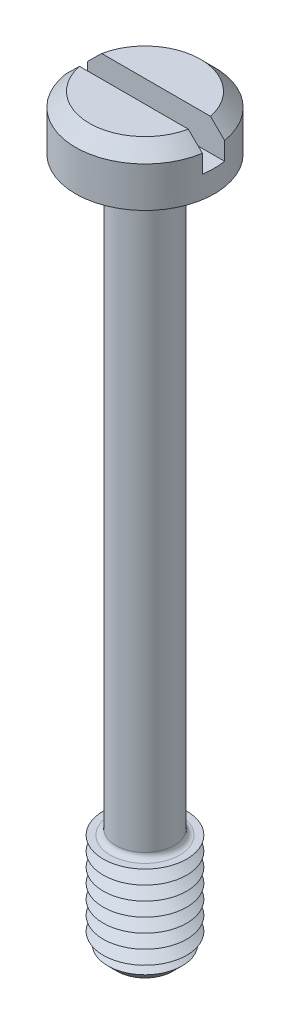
ISO-10303-21;
HEADER;
FILE_DESCRIPTION(('STEP AP214'),'2;1');
FILE_NAME('part.step','',(''),(''),'','','');
FILE_SCHEMA(('AUTOMOTIVE_DESIGN { 1 0 10303 214 1 1 1 1 }'));
ENDSEC;
DATA;
#1=APPLICATION_CONTEXT('core data for automotive mechanical design processes');
#2=APPLICATION_PROTOCOL_DEFINITION('international standard','automotive_design',2000,#1);
#3=PRODUCT_CONTEXT('',#1,'mechanical');
#4=PRODUCT('Part','Part','',(#3));
#5=PRODUCT_RELATED_PRODUCT_CATEGORY('part','',(#4));
#6=PRODUCT_DEFINITION_FORMATION('','',#4);
#7=PRODUCT_DEFINITION_CONTEXT('part definition',#1,'design');
#8=PRODUCT_DEFINITION('design','',#6,#7);
#9=PRODUCT_DEFINITION_SHAPE('','',#8);
#10=(LENGTH_UNIT() NAMED_UNIT(*) SI_UNIT(.MILLI.,.METRE.));
#11=(NAMED_UNIT(*) PLANE_ANGLE_UNIT() SI_UNIT($,.RADIAN.));
#12=(NAMED_UNIT(*) SI_UNIT($,.STERADIAN.) SOLID_ANGLE_UNIT());
#13=UNCERTAINTY_MEASURE_WITH_UNIT(LENGTH_MEASURE(1.E-05),#10,'distance_accuracy_value','');
#14=(GEOMETRIC_REPRESENTATION_CONTEXT(3) GLOBAL_UNCERTAINTY_ASSIGNED_CONTEXT((#13)) GLOBAL_UNIT_ASSIGNED_CONTEXT((#10,
#11,#12)) REPRESENTATION_CONTEXT('',''));
#15=CARTESIAN_POINT('',(0.,0.,0.));
#16=DIRECTION('',(0.,0.,1.));
#17=DIRECTION('',(1.,0.,0.));
#18=AXIS2_PLACEMENT_3D('',#15,#16,#17);
#19=CARTESIAN_POINT('',(0.,3.9,0.));
#20=DIRECTION('',(0.,1.,0.));
#21=DIRECTION('',(0.,0.,1.));
#22=AXIS2_PLACEMENT_3D('',#19,#20,#21);
#23=PLANE('',#22);
#24=DIRECTION('',(-1.,0.,0.));
#25=VECTOR('',#24,1.);
#26=CARTESIAN_POINT('',(5.,3.9,-0.8));
#27=LINE('',#26,#25);
#28=CARTESIAN_POINT('',(3.91918358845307,3.9,-0.8));
#29=VERTEX_POINT('',#28);
#30=CARTESIAN_POINT('',(-3.91918358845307,3.9,-0.8));
#31=VERTEX_POINT('',#30);
#32=EDGE_CURVE('E110',#29,#31,#27,.T.);
#33=ORIENTED_EDGE('',*,*,#32,.F.);
#34=CARTESIAN_POINT('',(0.,3.9,0.));
#35=DIRECTION('',(0.,1.,0.));
#36=DIRECTION('',(0.,0.,1.));
#37=AXIS2_PLACEMENT_3D('',#34,#35,#36);
#38=CIRCLE('',#37,3.99999999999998);
#39=EDGE_CURVE('E113',#29,#31,#38,.T.);
#40=ORIENTED_EDGE('',*,*,#39,.T.);
#41=EDGE_LOOP('',(#33,#40));
#42=FACE_BOUND('',#41,.T.);
#43=ADVANCED_FACE('F39',(#42),#23,.T.);
#44=CARTESIAN_POINT('',(0.,3.9,0.));
#45=DIRECTION('',(0.,-1.,0.));
#46=DIRECTION('',(0.,0.,-1.));
#47=AXIS2_PLACEMENT_3D('',#44,#45,#46);
#48=CONICAL_SURFACE('',#47,3.99999999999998,0.785398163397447);
#49=CARTESIAN_POINT('',(11.0010756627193,-3.13012537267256,-0.8));
#50=CARTESIAN_POINT('',(10.6180645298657,-2.74813121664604,-0.8));
#51=CARTESIAN_POINT('',(10.2350087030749,-2.36618183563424,-0.8));
#52=CARTESIAN_POINT('',(9.46873746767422,-1.60241986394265,-0.8));
#53=CARTESIAN_POINT('',(9.08552205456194,-1.22060727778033,-0.8));
#54=CARTESIAN_POINT('',(8.31861292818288,-0.456918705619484,-0.8));
#55=CARTESIAN_POINT('',(7.93491906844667,-0.0750428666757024,-0.8));
#56=CARTESIAN_POINT('',(7.16722555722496,0.688378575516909,-0.8));
#57=CARTESIAN_POINT('',(6.78322591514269,1.06992418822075,-0.8));
#58=CARTESIAN_POINT('',(6.01856215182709,1.82868912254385,-0.8));
#59=CARTESIAN_POINT('',(5.63790309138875,2.20591354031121,-0.8));
#60=CARTESIAN_POINT('',(5.06622054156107,2.77108317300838,-0.8));
#61=CARTESIAN_POINT('',(4.87553531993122,2.95937045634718,-0.8));
#62=CARTESIAN_POINT('',(4.49384424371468,3.3356164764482,-0.8));
#63=CARTESIAN_POINT('',(4.30283839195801,3.52357521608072,-0.8));
#64=CARTESIAN_POINT('',(3.92044271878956,3.89893397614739,-0.8));
#65=CARTESIAN_POINT('',(3.72905310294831,4.08633420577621,-0.8));
#66=CARTESIAN_POINT('',(3.34554223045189,4.46039762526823,-0.8));
#67=CARTESIAN_POINT('',(3.15342094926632,4.64706078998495,-0.8));
#68=CARTESIAN_POINT('',(2.76802565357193,5.01913697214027,-0.8));
#69=CARTESIAN_POINT('',(2.57475182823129,5.20455018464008,-0.8));
#70=CARTESIAN_POINT('',(2.28318236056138,5.48091108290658,-0.8));
#71=CARTESIAN_POINT('',(2.1857187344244,5.57273577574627,-0.8));
#72=CARTESIAN_POINT('',(1.98998431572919,5.75552004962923,-0.8));
#73=CARTESIAN_POINT('',(1.89171354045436,5.84647964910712,-0.8));
#74=CARTESIAN_POINT('',(1.76578543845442,5.96147491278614,-0.8));
#75=CARTESIAN_POINT('',(1.73869031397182,5.98612635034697,-0.8));
#76=CARTESIAN_POINT('',(1.68439529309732,6.03531372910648,-0.8));
#77=CARTESIAN_POINT('',(1.65719539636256,6.05984966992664,-0.8));
#78=CARTESIAN_POINT('',(1.5754162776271,6.13326356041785,-0.8));
#79=CARTESIAN_POINT('',(1.52066027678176,6.18194515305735,-0.8));
#80=CARTESIAN_POINT('',(1.41038257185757,6.27874171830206,-0.8));
#81=CARTESIAN_POINT('',(1.35485918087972,6.32685477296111,-0.8));
#82=CARTESIAN_POINT('',(1.24299231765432,6.42210730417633,-0.8));
#83=CARTESIAN_POINT('',(1.18664895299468,6.46924690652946,-0.8));
#84=CARTESIAN_POINT('',(1.07845249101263,6.55754663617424,-0.8));
#85=CARTESIAN_POINT('',(1.02670624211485,6.59883713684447,-0.8));
#86=CARTESIAN_POINT('',(0.921961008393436,6.67979338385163,-0.8));
#87=CARTESIAN_POINT('',(0.868962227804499,6.71945939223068,-0.8));
#88=CARTESIAN_POINT('',(0.761295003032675,6.79630361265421,-0.8));
#89=CARTESIAN_POINT('',(0.706629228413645,6.83348552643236,-0.8));
#90=CARTESIAN_POINT('',(0.594896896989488,6.90399895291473,-0.8));
#91=CARTESIAN_POINT('',(0.537833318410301,6.93733506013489,-0.8));
#92=CARTESIAN_POINT('',(0.428390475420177,6.99356340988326,-0.8));
#93=CARTESIAN_POINT('',(0.376435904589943,7.01726022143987,-0.8));
#94=CARTESIAN_POINT('',(0.269759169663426,7.05717670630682,-0.8));
#95=CARTESIAN_POINT('',(0.215046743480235,7.07342088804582,-0.8));
#96=CARTESIAN_POINT('',(0.11301666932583,7.09332110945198,-0.8));
#97=CARTESIAN_POINT('',(0.0660435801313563,7.09866042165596,-0.8));
#98=CARTESIAN_POINT('',(-0.0280587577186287,7.1008887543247,-0.8));
#99=CARTESIAN_POINT('',(-0.0751877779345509,7.09778705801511,-0.8));
#100=CARTESIAN_POINT('',(-0.180723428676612,7.08192474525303,-0.8));
#101=CARTESIAN_POINT('',(-0.238762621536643,7.06679554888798,-0.8));
#102=CARTESIAN_POINT('',(-0.323499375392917,7.03748409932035,-0.8));
#103=CARTESIAN_POINT('',(-0.351441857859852,7.02656594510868,-0.8));
#104=CARTESIAN_POINT('',(-0.406569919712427,7.00295901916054,-0.8));
#105=CARTESIAN_POINT('',(-0.433755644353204,6.99027059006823,-0.8));
#106=CARTESIAN_POINT('',(-0.504673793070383,6.95489235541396,-0.8));
#107=CARTESIAN_POINT('',(-0.547808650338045,6.9310167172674,-0.8));
#108=CARTESIAN_POINT('',(-0.632566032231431,6.88069648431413,-0.8));
#109=CARTESIAN_POINT('',(-0.674187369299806,6.85424992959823,-0.8));
#110=CARTESIAN_POINT('',(-0.756326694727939,6.79950439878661,-0.8));
#111=CARTESIAN_POINT('',(-0.796841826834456,6.7712011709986,-0.8));
#112=CARTESIAN_POINT('',(-0.876938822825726,6.71329852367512,-0.8));
#113=CARTESIAN_POINT('',(-0.916520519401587,6.68369887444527,-0.8));
#114=CARTESIAN_POINT('',(-1.0346590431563,6.59312324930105,-0.8));
#115=CARTESIAN_POINT('',(-1.11211338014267,6.53071425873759,-0.8));
#116=CARTESIAN_POINT('',(-1.2650545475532,6.40381418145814,-0.8));
#117=CARTESIAN_POINT('',(-1.34054439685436,6.33932667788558,-0.8));
#118=CARTESIAN_POINT('',(-1.48913173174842,6.20997083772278,-0.8));
#119=CARTESIAN_POINT('',(-1.56224816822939,6.14512422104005,-0.8));
#120=CARTESIAN_POINT('',(-1.70765393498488,6.01451044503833,-0.8));
#121=CARTESIAN_POINT('',(-1.77994324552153,5.94874326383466,-0.8));
#122=CARTESIAN_POINT('',(-1.99594639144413,5.75046596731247,-0.8));
#123=CARTESIAN_POINT('',(-2.13877767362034,5.61699583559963,-0.8));
#124=CARTESIAN_POINT('',(-2.4232463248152,5.34853800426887,-0.8));
#125=CARTESIAN_POINT('',(-2.56488247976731,5.21354902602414,-0.8));
#126=CARTESIAN_POINT('',(-2.84730929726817,4.94270932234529,-0.8));
#127=CARTESIAN_POINT('',(-2.98810001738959,4.80685865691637,-0.8));
#128=CARTESIAN_POINT('',(-3.26818763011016,4.53549974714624,-0.8));
#129=CARTESIAN_POINT('',(-3.40748821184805,4.39999530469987,-0.8));
#130=CARTESIAN_POINT('',(-3.68570899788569,4.12859172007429,-0.8));
#131=CARTESIAN_POINT('',(-3.82462919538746,3.99269257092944,-0.8));
#132=CARTESIAN_POINT('',(-4.24087543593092,3.58468153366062,-0.8));
#133=CARTESIAN_POINT('',(-4.51779300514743,3.31215310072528,-0.8));
#134=CARTESIAN_POINT('',(-5.05279381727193,2.7844393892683,-0.8));
#135=CARTESIAN_POINT('',(-5.31091639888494,2.52929393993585,-0.8));
#136=CARTESIAN_POINT('',(-5.82680751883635,2.01864429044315,-0.8));
#137=CARTESIAN_POINT('',(-6.08457605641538,1.76314008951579,-0.8));
#138=CARTESIAN_POINT('',(-6.85760508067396,0.996194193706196,-0.8));
#139=CARTESIAN_POINT('',(-7.37251152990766,0.484395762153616,-0.8));
#140=CARTESIAN_POINT('',(-8.40657233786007,-0.544392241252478,-0.8));
#141=CARTESIAN_POINT('',(-8.92572224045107,-1.06138628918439,-0.8));
#142=CARTESIAN_POINT('',(-9.9636287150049,-2.09560660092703,-0.8));
#143=CARTESIAN_POINT('',(-10.4823853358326,-2.61283281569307,-0.8));
#144=CARTESIAN_POINT('',(-11.0010756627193,-3.13012537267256,-0.8));
#145=B_SPLINE_CURVE_WITH_KNOTS('',3,(#49,#50,#51,#52,#53,#54,#55,#56,#57,#58,#59,#60,#61,#62,
#63,#64,#65,#66,#67,#68,#69,#70,#71,#72,#73,#74,#75,#76,#77,#78,#79,#80,#81,#82,#83,#84,#85,#86,
#87,#88,#89,#90,#91,#92,#93,#94,#95,#96,#97,#98,#99,#100,#101,#102,#103,#104,#105,#106,#107,
#108,#109,#110,#111,#112,#113,#114,#115,#116,#117,#118,#119,#120,#121,#122,#123,#124,#125,#126,
#127,#128,#129,#130,#131,#132,#133,#134,#135,#136,#137,#138,#139,#140,#141,#142,#143,#144),
.UNSPECIFIED.,.F.,.F.,(4,2,2,2,2,2,2,2,2,2,2,2,2,2,2,2,2,2,2,2,2,2,2,2,2,2,2,2,2,2,2,2,2,2,2,2,
2,2,2,2,2,2,2,2,2,2,2,4),(0.,1.62282275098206,3.24569489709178,4.86971791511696,
6.49369278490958,8.10142191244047,8.90535980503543,9.70929063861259,10.5128682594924,
11.3164730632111,12.1199494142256,12.5216659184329,12.9233738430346,13.0332669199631,
13.1431603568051,13.3629580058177,13.5833578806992,13.8037290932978,14.0023112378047,
14.2008612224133,14.3991084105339,14.5971162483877,14.7680800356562,14.9384774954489,
15.0795987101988,15.2205647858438,15.3993585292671,15.4893211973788,15.5792664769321,
15.727032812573,15.8749126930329,16.0231439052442,16.1714014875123,16.4697244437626,
16.767558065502,17.0607348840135,17.35391868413,17.9403574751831,18.5273336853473,
19.1142694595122,19.6972736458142,20.2802881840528,21.4458742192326,22.5346981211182,
23.6235243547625,25.8015035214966,27.9995014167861,30.1971550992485),.UNSPECIFIED.);
#146=CARTESIAN_POINT('',(4.93558507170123,2.89999999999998,-0.8));
#147=VERTEX_POINT('',#146);
#148=EDGE_CURVE('E252',#147,#29,#145,.T.);
#149=ORIENTED_EDGE('',*,*,#148,.F.);
#150=CARTESIAN_POINT('',(0.,2.89999999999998,0.));
#151=DIRECTION('',(0.,1.,0.));
#152=DIRECTION('',(0.,0.,1.));
#153=AXIS2_PLACEMENT_3D('',#150,#151,#152);
#154=CIRCLE('',#153,5.);
#155=CARTESIAN_POINT('',(-4.93558507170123,2.89999999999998,-0.8));
#156=VERTEX_POINT('',#155);
#157=EDGE_CURVE('E128',#156,#147,#154,.F.);
#158=ORIENTED_EDGE('',*,*,#157,.F.);
#159=EDGE_CURVE('E102',#31,#156,#145,.T.);
#160=ORIENTED_EDGE('',*,*,#159,.F.);
#161=ORIENTED_EDGE('',*,*,#39,.F.);
#162=EDGE_LOOP('',(#149,#158,#160,#161));
#163=FACE_BOUND('',#162,.T.);
#164=ADVANCED_FACE('F214',(#163),#48,.T.);
#165=CARTESIAN_POINT('',(0.,-50.,0.));
#166=DIRECTION('',(0.,1.,0.));
#167=DIRECTION('',(0.,0.,1.));
#168=AXIS2_PLACEMENT_3D('',#165,#166,#167);
#169=CYLINDRICAL_SURFACE('',#168,2.1);
#170=CARTESIAN_POINT('',(0.,-42.1,0.));
#171=DIRECTION('',(0.,-1.,0.));
#172=DIRECTION('',(0.,0.,-1.));
#173=AXIS2_PLACEMENT_3D('',#170,#171,#172);
#174=CIRCLE('',#173,2.1);
#175=CARTESIAN_POINT('',(0.,-42.1,-2.1));
#176=VERTEX_POINT('',#175);
#177=EDGE_CURVE('E123',#176,#176,#174,.F.);
#178=ORIENTED_EDGE('',*,*,#177,.T.);
#179=EDGE_LOOP('',(#178));
#180=FACE_BOUND('',#179,.T.);
#181=CARTESIAN_POINT('',(0.,-0.399999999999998,0.));
#182=DIRECTION('',(0.,1.,0.));
#183=DIRECTION('',(0.,0.,1.));
#184=AXIS2_PLACEMENT_3D('',#181,#182,#183);
#185=CIRCLE('',#184,2.1);
#186=CARTESIAN_POINT('',(0.,-0.399999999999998,2.1));
#187=VERTEX_POINT('',#186);
#188=EDGE_CURVE('E350',#187,#187,#185,.F.);
#189=ORIENTED_EDGE('',*,*,#188,.T.);
#190=EDGE_LOOP('',(#189));
#191=FACE_BOUND('',#190,.T.);
#192=ADVANCED_FACE('F210',(#180,#191),#169,.T.);
#193=CARTESIAN_POINT('',(0.,3.9,0.));
#194=DIRECTION('',(0.,-1.,0.));
#195=DIRECTION('',(0.,0.,-1.));
#196=AXIS2_PLACEMENT_3D('',#193,#194,#195);
#197=CYLINDRICAL_SURFACE('',#196,5.);
#198=ORIENTED_EDGE('',*,*,#157,.T.);
#199=DIRECTION('',(0.,-1.,0.));
#200=VECTOR('',#199,1.);
#201=CARTESIAN_POINT('',(4.93558507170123,3.9,-0.8));
#202=LINE('',#201,#200);
#203=CARTESIAN_POINT('',(4.93558507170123,1.6,-0.8));
#204=VERTEX_POINT('',#203);
#205=EDGE_CURVE('E64',#147,#204,#202,.T.);
#206=ORIENTED_EDGE('',*,*,#205,.T.);
#207=CARTESIAN_POINT('',(0.,1.6,0.));
#208=DIRECTION('',(0.,1.,0.));
#209=DIRECTION('',(0.,0.,1.));
#210=AXIS2_PLACEMENT_3D('',#207,#208,#209);
#211=CIRCLE('',#210,5.);
#212=CARTESIAN_POINT('',(4.93558507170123,1.6,0.8));
#213=VERTEX_POINT('',#212);
#214=EDGE_CURVE('E11',#213,#204,#211,.T.);
#215=ORIENTED_EDGE('',*,*,#214,.F.);
#216=DIRECTION('',(0.,-1.,0.));
#217=VECTOR('',#216,1.);
#218=CARTESIAN_POINT('',(4.93558507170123,3.9,0.8));
#219=LINE('',#218,#217);
#220=CARTESIAN_POINT('',(4.93558507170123,2.89999999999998,0.8));
#221=VERTEX_POINT('',#220);
#222=EDGE_CURVE('E269',#213,#221,#219,.F.);
#223=ORIENTED_EDGE('',*,*,#222,.T.);
#224=CARTESIAN_POINT('',(-4.93558507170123,2.89999999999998,0.8));
#225=VERTEX_POINT('',#224);
#226=EDGE_CURVE('E120',#221,#225,#154,.F.);
#227=ORIENTED_EDGE('',*,*,#226,.T.);
#228=DIRECTION('',(0.,-1.,0.));
#229=VECTOR('',#228,1.);
#230=CARTESIAN_POINT('',(-4.93558507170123,3.9,0.8));
#231=LINE('',#230,#229);
#232=CARTESIAN_POINT('',(-4.93558507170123,1.6,0.8));
#233=VERTEX_POINT('',#232);
#234=EDGE_CURVE('E96',#225,#233,#231,.T.);
#235=ORIENTED_EDGE('',*,*,#234,.T.);
#236=CARTESIAN_POINT('',(-4.93558507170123,1.6,-0.8));
#237=VERTEX_POINT('',#236);
#238=EDGE_CURVE('E44',#237,#233,#211,.T.);
#239=ORIENTED_EDGE('',*,*,#238,.F.);
#240=DIRECTION('',(0.,-1.,0.));
#241=VECTOR('',#240,1.);
#242=CARTESIAN_POINT('',(-4.93558507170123,3.9,-0.8));
#243=LINE('',#242,#241);
#244=EDGE_CURVE('E274',#237,#156,#243,.F.);
#245=ORIENTED_EDGE('',*,*,#244,.T.);
#246=EDGE_LOOP('',(#198,#206,#215,#223,#227,#235,#239,#245));
#247=FACE_BOUND('',#246,.T.);
#248=CARTESIAN_POINT('',(0.,0.,0.));
#249=DIRECTION('',(0.,1.,0.));
#250=DIRECTION('',(0.,0.,1.));
#251=AXIS2_PLACEMENT_3D('',#248,#249,#250);
#252=CIRCLE('',#251,5.);
#253=CARTESIAN_POINT('',(0.,0.,5.));
#254=VERTEX_POINT('',#253);
#255=EDGE_CURVE('E337',#254,#254,#252,.T.);
#256=ORIENTED_EDGE('',*,*,#255,.T.);
#257=EDGE_LOOP('',(#256));
#258=FACE_BOUND('',#257,.T.);
#259=ADVANCED_FACE('F213',(#247,#258),#197,.T.);
#260=DIRECTION('',(1.,0.,0.));
#261=VECTOR('',#260,1.);
#262=CARTESIAN_POINT('',(5.,3.9,0.8));
#263=LINE('',#262,#261);
#264=CARTESIAN_POINT('',(-3.91918358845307,3.9,0.8));
#265=VERTEX_POINT('',#264);
#266=CARTESIAN_POINT('',(3.91918358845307,3.9,0.8));
#267=VERTEX_POINT('',#266);
#268=EDGE_CURVE('E56',#265,#267,#263,.T.);
#269=ORIENTED_EDGE('',*,*,#268,.F.);
#270=EDGE_CURVE('E108',#265,#267,#38,.T.);
#271=ORIENTED_EDGE('',*,*,#270,.T.);
#272=EDGE_LOOP('',(#269,#271));
#273=FACE_BOUND('',#272,.T.);
#274=ADVANCED_FACE('F107',(#273),#23,.T.);
#275=CARTESIAN_POINT('',(0.,0.,0.));
#276=DIRECTION('',(0.,1.,0.));
#277=DIRECTION('',(0.,0.,1.));
#278=AXIS2_PLACEMENT_3D('',#275,#276,#277);
#279=PLANE('',#278);
#280=CARTESIAN_POINT('',(0.,0.,0.));
#281=DIRECTION('',(0.,1.,0.));
#282=DIRECTION('',(0.,0.,1.));
#283=AXIS2_PLACEMENT_3D('',#280,#281,#282);
#284=CIRCLE('',#283,2.5);
#285=CARTESIAN_POINT('',(0.,0.,2.5));
#286=VERTEX_POINT('',#285);
#287=EDGE_CURVE('E114',#286,#286,#284,.T.);
#288=ORIENTED_EDGE('',*,*,#287,.T.);
#289=EDGE_LOOP('',(#288));
#290=FACE_BOUND('',#289,.T.);
#291=ORIENTED_EDGE('',*,*,#255,.F.);
#292=EDGE_LOOP('',(#291));
#293=FACE_BOUND('',#292,.T.);
#294=ADVANCED_FACE('F204',(#290,#293),#279,.F.);
#295=CARTESIAN_POINT('',(0.,-42.5,0.));
#296=DIRECTION('',(0.,-1.,0.));
#297=DIRECTION('',(0.,0.,-1.));
#298=AXIS2_PLACEMENT_3D('',#295,#296,#297);
#299=PLANE('',#298);
#300=CARTESIAN_POINT('',(0.,-42.5,0.));
#301=DIRECTION('',(0.,-1.,0.));
#302=DIRECTION('',(0.,0.,-1.));
#303=AXIS2_PLACEMENT_3D('',#300,#301,#302);
#304=CIRCLE('',#303,2.5);
#305=CARTESIAN_POINT('',(0.,-42.5,-2.5));
#306=VERTEX_POINT('',#305);
#307=EDGE_CURVE('E344',#306,#306,#304,.T.);
#308=ORIENTED_EDGE('',*,*,#307,.T.);
#309=EDGE_LOOP('',(#308));
#310=FACE_BOUND('',#309,.T.);
#311=CARTESIAN_POINT('',(0.,-42.5,0.));
#312=DIRECTION('',(0.,1.,0.));
#313=DIRECTION('',(0.,0.,1.));
#314=AXIS2_PLACEMENT_3D('',#311,#312,#313);
#315=CIRCLE('',#314,3.);
#316=CARTESIAN_POINT('',(0.,-42.5,3.));
#317=VERTEX_POINT('',#316);
#318=EDGE_CURVE('E333',#317,#317,#315,.T.);
#319=ORIENTED_EDGE('',*,*,#318,.T.);
#320=EDGE_LOOP('',(#319));
#321=FACE_BOUND('',#320,.T.);
#322=ADVANCED_FACE('F200',(#310,#321),#299,.F.);
#323=CARTESIAN_POINT('',(0.,-43.,0.));
#324=DIRECTION('',(0.,1.,0.));
#325=DIRECTION('',(0.,0.,1.));
#326=AXIS2_PLACEMENT_3D('',#323,#324,#325);
#327=CONICAL_SURFACE('',#326,2.13397459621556,1.0471975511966);
#328=ORIENTED_EDGE('',*,*,#318,.F.);
#329=EDGE_LOOP('',(#328));
#330=FACE_BOUND('',#329,.T.);
#331=CARTESIAN_POINT('',(0.,-43.,0.));
#332=DIRECTION('',(0.,1.,0.));
#333=DIRECTION('',(0.,0.,1.));
#334=AXIS2_PLACEMENT_3D('',#331,#332,#333);
#335=CIRCLE('',#334,2.13397459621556);
#336=CARTESIAN_POINT('',(0.,-43.,2.13397459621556));
#337=VERTEX_POINT('',#336);
#338=EDGE_CURVE('E329',#337,#337,#335,.T.);
#339=ORIENTED_EDGE('',*,*,#338,.T.);
#340=EDGE_LOOP('',(#339));
#341=FACE_BOUND('',#340,.T.);
#342=ADVANCED_FACE('F196',(#330,#341),#327,.T.);
#343=CARTESIAN_POINT('',(0.,-43.5,0.));
#344=DIRECTION('',(0.,-1.,0.));
#345=DIRECTION('',(0.,0.,-1.));
#346=AXIS2_PLACEMENT_3D('',#343,#344,#345);
#347=CONICAL_SURFACE('',#346,3.,1.0471975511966);
#348=ORIENTED_EDGE('',*,*,#338,.F.);
#349=EDGE_LOOP('',(#348));
#350=FACE_BOUND('',#349,.T.);
#351=CARTESIAN_POINT('',(0.,-43.5,0.));
#352=DIRECTION('',(0.,1.,0.));
#353=DIRECTION('',(0.,0.,1.));
#354=AXIS2_PLACEMENT_3D('',#351,#352,#353);
#355=CIRCLE('',#354,3.);
#356=CARTESIAN_POINT('',(0.,-43.5,3.));
#357=VERTEX_POINT('',#356);
#358=EDGE_CURVE('E325',#357,#357,#355,.T.);
#359=ORIENTED_EDGE('',*,*,#358,.T.);
#360=EDGE_LOOP('',(#359));
#361=FACE_BOUND('',#360,.T.);
#362=ADVANCED_FACE('F192',(#350,#361),#347,.T.);
#363=CARTESIAN_POINT('',(0.,-44.,0.));
#364=DIRECTION('',(0.,1.,0.));
#365=DIRECTION('',(0.,0.,1.));
#366=AXIS2_PLACEMENT_3D('',#363,#364,#365);
#367=CONICAL_SURFACE('',#366,2.13397459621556,1.0471975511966);
#368=ORIENTED_EDGE('',*,*,#358,.F.);
#369=EDGE_LOOP('',(#368));
#370=FACE_BOUND('',#369,.T.);
#371=CARTESIAN_POINT('',(0.,-44.,0.));
#372=DIRECTION('',(0.,1.,0.));
#373=DIRECTION('',(0.,0.,1.));
#374=AXIS2_PLACEMENT_3D('',#371,#372,#373);
#375=CIRCLE('',#374,2.13397459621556);
#376=CARTESIAN_POINT('',(0.,-44.,2.13397459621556));
#377=VERTEX_POINT('',#376);
#378=EDGE_CURVE('E321',#377,#377,#375,.T.);
#379=ORIENTED_EDGE('',*,*,#378,.T.);
#380=EDGE_LOOP('',(#379));
#381=FACE_BOUND('',#380,.T.);
#382=ADVANCED_FACE('F188',(#370,#381),#367,.T.);
#383=CARTESIAN_POINT('',(0.,-44.5,0.));
#384=DIRECTION('',(0.,-1.,0.));
#385=DIRECTION('',(0.,0.,-1.));
#386=AXIS2_PLACEMENT_3D('',#383,#384,#385);
#387=CONICAL_SURFACE('',#386,3.,1.0471975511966);
#388=ORIENTED_EDGE('',*,*,#378,.F.);
#389=EDGE_LOOP('',(#388));
#390=FACE_BOUND('',#389,.T.);
#391=CARTESIAN_POINT('',(0.,-44.5,0.));
#392=DIRECTION('',(0.,1.,0.));
#393=DIRECTION('',(0.,0.,1.));
#394=AXIS2_PLACEMENT_3D('',#391,#392,#393);
#395=CIRCLE('',#394,3.);
#396=CARTESIAN_POINT('',(0.,-44.5,3.));
#397=VERTEX_POINT('',#396);
#398=EDGE_CURVE('E318',#397,#397,#395,.T.);
#399=ORIENTED_EDGE('',*,*,#398,.T.);
#400=EDGE_LOOP('',(#399));
#401=FACE_BOUND('',#400,.T.);
#402=ADVANCED_FACE('F184',(#390,#401),#387,.T.);
#403=CARTESIAN_POINT('',(0.,-45.,0.));
#404=DIRECTION('',(0.,1.,0.));
#405=DIRECTION('',(0.,0.,1.));
#406=AXIS2_PLACEMENT_3D('',#403,#404,#405);
#407=CONICAL_SURFACE('',#406,2.13397459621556,1.0471975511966);
#408=ORIENTED_EDGE('',*,*,#398,.F.);
#409=EDGE_LOOP('',(#408));
#410=FACE_BOUND('',#409,.T.);
#411=CARTESIAN_POINT('',(0.,-45.,0.));
#412=DIRECTION('',(0.,1.,0.));
#413=DIRECTION('',(0.,0.,1.));
#414=AXIS2_PLACEMENT_3D('',#411,#412,#413);
#415=CIRCLE('',#414,2.13397459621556);
#416=CARTESIAN_POINT('',(0.,-45.,2.13397459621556));
#417=VERTEX_POINT('',#416);
#418=EDGE_CURVE('E315',#417,#417,#415,.T.);
#419=ORIENTED_EDGE('',*,*,#418,.T.);
#420=EDGE_LOOP('',(#419));
#421=FACE_BOUND('',#420,.T.);
#422=ADVANCED_FACE('F180',(#410,#421),#407,.T.);
#423=CARTESIAN_POINT('',(0.,-45.5,0.));
#424=DIRECTION('',(0.,-1.,0.));
#425=DIRECTION('',(0.,0.,-1.));
#426=AXIS2_PLACEMENT_3D('',#423,#424,#425);
#427=CONICAL_SURFACE('',#426,3.,1.0471975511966);
#428=ORIENTED_EDGE('',*,*,#418,.F.);
#429=EDGE_LOOP('',(#428));
#430=FACE_BOUND('',#429,.T.);
#431=CARTESIAN_POINT('',(0.,-45.5,0.));
#432=DIRECTION('',(0.,1.,0.));
#433=DIRECTION('',(0.,0.,1.));
#434=AXIS2_PLACEMENT_3D('',#431,#432,#433);
#435=CIRCLE('',#434,3.);
#436=CARTESIAN_POINT('',(0.,-45.5,3.));
#437=VERTEX_POINT('',#436);
#438=EDGE_CURVE('E311',#437,#437,#435,.T.);
#439=ORIENTED_EDGE('',*,*,#438,.T.);
#440=EDGE_LOOP('',(#439));
#441=FACE_BOUND('',#440,.T.);
#442=ADVANCED_FACE('F176',(#430,#441),#427,.T.);
#443=CARTESIAN_POINT('',(0.,-46.,0.));
#444=DIRECTION('',(0.,1.,0.));
#445=DIRECTION('',(0.,0.,1.));
#446=AXIS2_PLACEMENT_3D('',#443,#444,#445);
#447=CONICAL_SURFACE('',#446,2.13397459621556,1.0471975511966);
#448=ORIENTED_EDGE('',*,*,#438,.F.);
#449=EDGE_LOOP('',(#448));
#450=FACE_BOUND('',#449,.T.);
#451=CARTESIAN_POINT('',(0.,-46.,0.));
#452=DIRECTION('',(0.,1.,0.));
#453=DIRECTION('',(0.,0.,1.));
#454=AXIS2_PLACEMENT_3D('',#451,#452,#453);
#455=CIRCLE('',#454,2.13397459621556);
#456=CARTESIAN_POINT('',(0.,-46.,2.13397459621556));
#457=VERTEX_POINT('',#456);
#458=EDGE_CURVE('E308',#457,#457,#455,.T.);
#459=ORIENTED_EDGE('',*,*,#458,.T.);
#460=EDGE_LOOP('',(#459));
#461=FACE_BOUND('',#460,.T.);
#462=ADVANCED_FACE('F172',(#450,#461),#447,.T.);
#463=CARTESIAN_POINT('',(0.,-46.5,0.));
#464=DIRECTION('',(0.,-1.,0.));
#465=DIRECTION('',(0.,0.,-1.));
#466=AXIS2_PLACEMENT_3D('',#463,#464,#465);
#467=CONICAL_SURFACE('',#466,3.,1.0471975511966);
#468=ORIENTED_EDGE('',*,*,#458,.F.);
#469=EDGE_LOOP('',(#468));
#470=FACE_BOUND('',#469,.T.);
#471=CARTESIAN_POINT('',(0.,-46.5,0.));
#472=DIRECTION('',(0.,1.,0.));
#473=DIRECTION('',(0.,0.,1.));
#474=AXIS2_PLACEMENT_3D('',#471,#472,#473);
#475=CIRCLE('',#474,3.);
#476=CARTESIAN_POINT('',(0.,-46.5,3.));
#477=VERTEX_POINT('',#476);
#478=EDGE_CURVE('E304',#477,#477,#475,.T.);
#479=ORIENTED_EDGE('',*,*,#478,.T.);
#480=EDGE_LOOP('',(#479));
#481=FACE_BOUND('',#480,.T.);
#482=ADVANCED_FACE('F168',(#470,#481),#467,.T.);
#483=CARTESIAN_POINT('',(0.,-47.,0.));
#484=DIRECTION('',(0.,1.,0.));
#485=DIRECTION('',(0.,0.,1.));
#486=AXIS2_PLACEMENT_3D('',#483,#484,#485);
#487=CONICAL_SURFACE('',#486,2.13397459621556,1.0471975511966);
#488=ORIENTED_EDGE('',*,*,#478,.F.);
#489=EDGE_LOOP('',(#488));
#490=FACE_BOUND('',#489,.T.);
#491=CARTESIAN_POINT('',(0.,-47.,0.));
#492=DIRECTION('',(0.,1.,0.));
#493=DIRECTION('',(0.,0.,1.));
#494=AXIS2_PLACEMENT_3D('',#491,#492,#493);
#495=CIRCLE('',#494,2.13397459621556);
#496=CARTESIAN_POINT('',(0.,-47.,2.13397459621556));
#497=VERTEX_POINT('',#496);
#498=EDGE_CURVE('E300',#497,#497,#495,.T.);
#499=ORIENTED_EDGE('',*,*,#498,.T.);
#500=EDGE_LOOP('',(#499));
#501=FACE_BOUND('',#500,.T.);
#502=ADVANCED_FACE('F164',(#490,#501),#487,.T.);
#503=CARTESIAN_POINT('',(0.,-47.5,0.));
#504=DIRECTION('',(0.,-1.,0.));
#505=DIRECTION('',(0.,0.,-1.));
#506=AXIS2_PLACEMENT_3D('',#503,#504,#505);
#507=CONICAL_SURFACE('',#506,3.,1.0471975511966);
#508=ORIENTED_EDGE('',*,*,#498,.F.);
#509=EDGE_LOOP('',(#508));
#510=FACE_BOUND('',#509,.T.);
#511=CARTESIAN_POINT('',(0.,-47.5,0.));
#512=DIRECTION('',(0.,1.,0.));
#513=DIRECTION('',(0.,0.,1.));
#514=AXIS2_PLACEMENT_3D('',#511,#512,#513);
#515=CIRCLE('',#514,3.);
#516=CARTESIAN_POINT('',(0.,-47.5,3.));
#517=VERTEX_POINT('',#516);
#518=EDGE_CURVE('E296',#517,#517,#515,.T.);
#519=ORIENTED_EDGE('',*,*,#518,.T.);
#520=EDGE_LOOP('',(#519));
#521=FACE_BOUND('',#520,.T.);
#522=ADVANCED_FACE('F160',(#510,#521),#507,.T.);
#523=CARTESIAN_POINT('',(0.,-48.,0.));
#524=DIRECTION('',(0.,1.,0.));
#525=DIRECTION('',(0.,0.,1.));
#526=AXIS2_PLACEMENT_3D('',#523,#524,#525);
#527=CONICAL_SURFACE('',#526,2.13397459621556,1.0471975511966);
#528=ORIENTED_EDGE('',*,*,#518,.F.);
#529=EDGE_LOOP('',(#528));
#530=FACE_BOUND('',#529,.T.);
#531=CARTESIAN_POINT('',(0.,-48.,0.));
#532=DIRECTION('',(0.,1.,0.));
#533=DIRECTION('',(0.,0.,1.));
#534=AXIS2_PLACEMENT_3D('',#531,#532,#533);
#535=CIRCLE('',#534,2.13397459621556);
#536=CARTESIAN_POINT('',(0.,-48.,2.13397459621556));
#537=VERTEX_POINT('',#536);
#538=EDGE_CURVE('E292',#537,#537,#535,.T.);
#539=ORIENTED_EDGE('',*,*,#538,.T.);
#540=EDGE_LOOP('',(#539));
#541=FACE_BOUND('',#540,.T.);
#542=ADVANCED_FACE('F156',(#530,#541),#527,.T.);
#543=CARTESIAN_POINT('',(0.,-48.5,0.));
#544=DIRECTION('',(0.,-1.,0.));
#545=DIRECTION('',(0.,0.,-1.));
#546=AXIS2_PLACEMENT_3D('',#543,#544,#545);
#547=CONICAL_SURFACE('',#546,3.,1.0471975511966);
#548=ORIENTED_EDGE('',*,*,#538,.F.);
#549=EDGE_LOOP('',(#548));
#550=FACE_BOUND('',#549,.T.);
#551=CARTESIAN_POINT('',(0.,-48.5,0.));
#552=DIRECTION('',(0.,1.,0.));
#553=DIRECTION('',(0.,0.,1.));
#554=AXIS2_PLACEMENT_3D('',#551,#552,#553);
#555=CIRCLE('',#554,3.);
#556=CARTESIAN_POINT('',(0.,-48.5,3.));
#557=VERTEX_POINT('',#556);
#558=EDGE_CURVE('E287',#557,#557,#555,.T.);
#559=ORIENTED_EDGE('',*,*,#558,.T.);
#560=EDGE_LOOP('',(#559));
#561=FACE_BOUND('',#560,.T.);
#562=ADVANCED_FACE('F152',(#550,#561),#547,.T.);
#563=CARTESIAN_POINT('',(0.,-49.,0.));
#564=DIRECTION('',(0.,1.,0.));
#565=DIRECTION('',(0.,0.,1.));
#566=AXIS2_PLACEMENT_3D('',#563,#564,#565);
#567=CONICAL_SURFACE('',#566,2.13397459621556,1.0471975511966);
#568=ORIENTED_EDGE('',*,*,#558,.F.);
#569=EDGE_LOOP('',(#568));
#570=FACE_BOUND('',#569,.T.);
#571=CARTESIAN_POINT('',(0.,-49.,0.));
#572=DIRECTION('',(0.,1.,0.));
#573=DIRECTION('',(0.,0.,1.));
#574=AXIS2_PLACEMENT_3D('',#571,#572,#573);
#575=CIRCLE('',#574,2.13397459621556);
#576=CARTESIAN_POINT('',(0.,-49.,2.13397459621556));
#577=VERTEX_POINT('',#576);
#578=EDGE_CURVE('E283',#577,#577,#575,.T.);
#579=ORIENTED_EDGE('',*,*,#578,.T.);
#580=EDGE_LOOP('',(#579));
#581=FACE_BOUND('',#580,.T.);
#582=ADVANCED_FACE('F148',(#570,#581),#567,.T.);
#583=CARTESIAN_POINT('',(0.,-49.5,0.));
#584=DIRECTION('',(0.,-1.,0.));
#585=DIRECTION('',(0.,0.,-1.));
#586=AXIS2_PLACEMENT_3D('',#583,#584,#585);
#587=CONICAL_SURFACE('',#586,3.,1.0471975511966);
#588=CARTESIAN_POINT('',(0.,-49.3169872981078,0.));
#589=DIRECTION('',(0.,-1.,0.));
#590=DIRECTION('',(0.,0.,-1.));
#591=AXIS2_PLACEMENT_3D('',#588,#589,#590);
#592=CIRCLE('',#591,2.68301270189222);
#593=CARTESIAN_POINT('',(0.,-49.3169872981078,-2.68301270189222));
#594=VERTEX_POINT('',#593);
#595=EDGE_CURVE('E291',#594,#594,#592,.F.);
#596=ORIENTED_EDGE('',*,*,#595,.T.);
#597=EDGE_LOOP('',(#596));
#598=FACE_BOUND('',#597,.T.);
#599=ORIENTED_EDGE('',*,*,#578,.F.);
#600=EDGE_LOOP('',(#599));
#601=FACE_BOUND('',#600,.T.);
#602=ADVANCED_FACE('F144',(#598,#601),#587,.T.);
#603=CARTESIAN_POINT('',(0.,-50.,0.));
#604=DIRECTION('',(0.,-1.,0.));
#605=DIRECTION('',(0.,0.,-1.));
#606=AXIS2_PLACEMENT_3D('',#603,#604,#605);
#607=PLANE('',#606);
#608=CARTESIAN_POINT('',(0.,-50.,0.));
#609=DIRECTION('',(0.,-1.,0.));
#610=DIRECTION('',(0.,0.,-1.));
#611=AXIS2_PLACEMENT_3D('',#608,#609,#610);
#612=CIRCLE('',#611,1.99999999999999);
#613=CARTESIAN_POINT('',(0.,-50.,-1.99999999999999));
#614=VERTEX_POINT('',#613);
#615=EDGE_CURVE('E341',#614,#614,#612,.T.);
#616=ORIENTED_EDGE('',*,*,#615,.T.);
#617=EDGE_LOOP('',(#616));
#618=FACE_BOUND('',#617,.T.);
#619=ADVANCED_FACE('F147',(#618),#607,.T.);
#620=CARTESIAN_POINT('',(0.,-50.,0.));
#621=DIRECTION('',(0.,1.,0.));
#622=DIRECTION('',(0.,0.,1.));
#623=AXIS2_PLACEMENT_3D('',#620,#621,#622);
#624=CONICAL_SURFACE('',#623,1.99999999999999,0.785398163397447);
#625=ORIENTED_EDGE('',*,*,#595,.F.);
#626=EDGE_LOOP('',(#625));
#627=FACE_BOUND('',#626,.T.);
#628=ORIENTED_EDGE('',*,*,#615,.F.);
#629=EDGE_LOOP('',(#628));
#630=FACE_BOUND('',#629,.T.);
#631=ADVANCED_FACE('F208',(#627,#630),#624,.T.);
#632=CARTESIAN_POINT('',(0.,-42.1,0.));
#633=DIRECTION('',(0.,-1.,0.));
#634=DIRECTION('',(0.,0.,-1.));
#635=AXIS2_PLACEMENT_3D('',#632,#633,#634);
#636=TOROIDAL_SURFACE('',#635,2.5,0.4);
#637=ORIENTED_EDGE('',*,*,#177,.F.);
#638=EDGE_LOOP('',(#637));
#639=FACE_BOUND('',#638,.T.);
#640=ORIENTED_EDGE('',*,*,#307,.F.);
#641=EDGE_LOOP('',(#640));
#642=FACE_BOUND('',#641,.T.);
#643=ADVANCED_FACE('F226',(#639,#642),#636,.F.);
#644=CARTESIAN_POINT('',(0.,-0.399999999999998,0.));
#645=DIRECTION('',(0.,1.,0.));
#646=DIRECTION('',(0.,0.,1.));
#647=AXIS2_PLACEMENT_3D('',#644,#645,#646);
#648=TOROIDAL_SURFACE('',#647,2.5,0.4);
#649=ORIENTED_EDGE('',*,*,#287,.F.);
#650=EDGE_LOOP('',(#649));
#651=FACE_BOUND('',#650,.T.);
#652=ORIENTED_EDGE('',*,*,#188,.F.);
#653=EDGE_LOOP('',(#652));
#654=FACE_BOUND('',#653,.T.);
#655=ADVANCED_FACE('F229',(#651,#654),#648,.F.);
#656=CARTESIAN_POINT('',(-11.0010756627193,-3.13012537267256,0.8));
#657=CARTESIAN_POINT('',(-10.6180645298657,-2.74813121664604,0.8));
#658=CARTESIAN_POINT('',(-10.2350087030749,-2.36618183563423,0.8));
#659=CARTESIAN_POINT('',(-9.46873746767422,-1.60241986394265,0.8));
#660=CARTESIAN_POINT('',(-9.08552205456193,-1.22060727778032,0.8));
#661=CARTESIAN_POINT('',(-8.31861292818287,-0.456918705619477,0.8));
#662=CARTESIAN_POINT('',(-7.93491906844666,-0.0750428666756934,0.8));
#663=CARTESIAN_POINT('',(-7.16722555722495,0.688378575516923,0.8));
#664=CARTESIAN_POINT('',(-6.78322591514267,1.06992418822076,0.8));
#665=CARTESIAN_POINT('',(-6.01856215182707,1.82868912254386,0.8));
#666=CARTESIAN_POINT('',(-5.63790309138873,2.20591354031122,0.8));
#667=CARTESIAN_POINT('',(-5.06622054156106,2.77108317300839,0.8));
#668=CARTESIAN_POINT('',(-4.87553531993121,2.95937045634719,0.8));
#669=CARTESIAN_POINT('',(-4.49384424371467,3.33561647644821,0.8));
#670=CARTESIAN_POINT('',(-4.302838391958,3.52357521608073,0.8));
#671=CARTESIAN_POINT('',(-3.92044271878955,3.89893397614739,0.8));
#672=CARTESIAN_POINT('',(-3.7290531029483,4.08633420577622,0.8));
#673=CARTESIAN_POINT('',(-3.34554223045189,4.46039762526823,0.8));
#674=CARTESIAN_POINT('',(-3.15342094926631,4.64706078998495,0.8));
#675=CARTESIAN_POINT('',(-2.76802565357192,5.01913697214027,0.8));
#676=CARTESIAN_POINT('',(-2.57475182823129,5.20455018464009,0.8));
#677=CARTESIAN_POINT('',(-2.28318236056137,5.48091108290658,0.8));
#678=CARTESIAN_POINT('',(-2.1857187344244,5.57273577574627,0.8));
#679=CARTESIAN_POINT('',(-1.98998431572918,5.75552004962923,0.8));
#680=CARTESIAN_POINT('',(-1.89171354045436,5.84647964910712,0.8));
#681=CARTESIAN_POINT('',(-1.76578543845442,5.96147491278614,0.8));
#682=CARTESIAN_POINT('',(-1.73869031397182,5.98612635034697,0.8));
#683=CARTESIAN_POINT('',(-1.68439529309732,6.03531372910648,0.8));
#684=CARTESIAN_POINT('',(-1.65719539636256,6.05984966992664,0.8));
#685=CARTESIAN_POINT('',(-1.5754162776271,6.13326356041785,0.8));
#686=CARTESIAN_POINT('',(-1.52066027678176,6.18194515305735,0.8));
#687=CARTESIAN_POINT('',(-1.41038257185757,6.27874171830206,0.8));
#688=CARTESIAN_POINT('',(-1.35485918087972,6.32685477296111,0.8));
#689=CARTESIAN_POINT('',(-1.24299231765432,6.42210730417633,0.8));
#690=CARTESIAN_POINT('',(-1.18664895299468,6.46924690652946,0.8));
#691=CARTESIAN_POINT('',(-1.07845249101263,6.55754663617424,0.8));
#692=CARTESIAN_POINT('',(-1.02670624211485,6.59883713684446,0.8));
#693=CARTESIAN_POINT('',(-0.921961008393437,6.67979338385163,0.8));
#694=CARTESIAN_POINT('',(-0.8689622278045,6.71945939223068,0.8));
#695=CARTESIAN_POINT('',(-0.761295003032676,6.79630361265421,0.8));
#696=CARTESIAN_POINT('',(-0.706629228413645,6.83348552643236,0.8));
#697=CARTESIAN_POINT('',(-0.594896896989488,6.90399895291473,0.8));
#698=CARTESIAN_POINT('',(-0.537833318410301,6.93733506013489,0.8));
#699=CARTESIAN_POINT('',(-0.428390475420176,6.99356340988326,0.8));
#700=CARTESIAN_POINT('',(-0.376435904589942,7.01726022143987,0.8));
#701=CARTESIAN_POINT('',(-0.269759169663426,7.05717670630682,0.8));
#702=CARTESIAN_POINT('',(-0.215046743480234,7.07342088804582,0.8));
#703=CARTESIAN_POINT('',(-0.113016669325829,7.09332110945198,0.8));
#704=CARTESIAN_POINT('',(-0.0660435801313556,7.09866042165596,0.8));
#705=CARTESIAN_POINT('',(0.0280587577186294,7.1008887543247,0.8));
#706=CARTESIAN_POINT('',(0.0751877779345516,7.09778705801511,0.8));
#707=CARTESIAN_POINT('',(0.180723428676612,7.08192474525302,0.8));
#708=CARTESIAN_POINT('',(0.238762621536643,7.06679554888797,0.8));
#709=CARTESIAN_POINT('',(0.323499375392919,7.03748409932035,0.8));
#710=CARTESIAN_POINT('',(0.351441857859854,7.02656594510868,0.8));
#711=CARTESIAN_POINT('',(0.40656991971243,7.00295901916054,0.8));
#712=CARTESIAN_POINT('',(0.433755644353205,6.99027059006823,0.8));
#713=CARTESIAN_POINT('',(0.504673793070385,6.95489235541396,0.8));
#714=CARTESIAN_POINT('',(0.547808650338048,6.9310167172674,0.8));
#715=CARTESIAN_POINT('',(0.632566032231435,6.88069648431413,0.8));
#716=CARTESIAN_POINT('',(0.67418736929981,6.85424992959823,0.8));
#717=CARTESIAN_POINT('',(0.756326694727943,6.79950439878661,0.8));
#718=CARTESIAN_POINT('',(0.796841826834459,6.7712011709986,0.8));
#719=CARTESIAN_POINT('',(0.876938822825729,6.71329852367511,0.8));
#720=CARTESIAN_POINT('',(0.91652051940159,6.68369887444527,0.8));
#721=CARTESIAN_POINT('',(1.03465904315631,6.59312324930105,0.8));
#722=CARTESIAN_POINT('',(1.11211338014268,6.53071425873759,0.8));
#723=CARTESIAN_POINT('',(1.26505454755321,6.40381418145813,0.8));
#724=CARTESIAN_POINT('',(1.34054439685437,6.33932667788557,0.8));
#725=CARTESIAN_POINT('',(1.48913173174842,6.20997083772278,0.8));
#726=CARTESIAN_POINT('',(1.56224816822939,6.14512422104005,0.8));
#727=CARTESIAN_POINT('',(1.70765393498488,6.01451044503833,0.8));
#728=CARTESIAN_POINT('',(1.77994324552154,5.94874326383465,0.8));
#729=CARTESIAN_POINT('',(1.99594639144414,5.75046596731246,0.8));
#730=CARTESIAN_POINT('',(2.13877767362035,5.61699583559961,0.8));
#731=CARTESIAN_POINT('',(2.42324632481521,5.34853800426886,0.8));
#732=CARTESIAN_POINT('',(2.56488247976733,5.21354902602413,0.8));
#733=CARTESIAN_POINT('',(2.84730929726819,4.94270932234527,0.8));
#734=CARTESIAN_POINT('',(2.98810001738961,4.80685865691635,0.8));
#735=CARTESIAN_POINT('',(3.26818763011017,4.53549974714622,0.8));
#736=CARTESIAN_POINT('',(3.40748821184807,4.39999530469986,0.8));
#737=CARTESIAN_POINT('',(3.68570899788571,4.12859172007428,0.8));
#738=CARTESIAN_POINT('',(3.82462919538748,3.99269257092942,0.8));
#739=CARTESIAN_POINT('',(4.24087543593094,3.5846815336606,0.8));
#740=CARTESIAN_POINT('',(4.51779300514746,3.31215310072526,0.8));
#741=CARTESIAN_POINT('',(5.05279381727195,2.78443938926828,0.8));
#742=CARTESIAN_POINT('',(5.31091639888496,2.52929393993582,0.8));
#743=CARTESIAN_POINT('',(5.82680751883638,2.01864429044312,0.8));
#744=CARTESIAN_POINT('',(6.0845760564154,1.76314008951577,0.8));
#745=CARTESIAN_POINT('',(6.85760508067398,0.996194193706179,0.8));
#746=CARTESIAN_POINT('',(7.37251152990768,0.4843957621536,0.8));
#747=CARTESIAN_POINT('',(8.40657233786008,-0.544392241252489,0.8));
#748=CARTESIAN_POINT('',(8.92572224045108,-1.0613862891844,0.8));
#749=CARTESIAN_POINT('',(9.9636287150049,-2.09560660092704,0.8));
#750=CARTESIAN_POINT('',(10.4823853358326,-2.61283281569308,0.8));
#751=CARTESIAN_POINT('',(11.0010756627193,-3.13012537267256,0.8));
#752=B_SPLINE_CURVE_WITH_KNOTS('',3,(#656,#657,#658,#659,#660,#661,#662,#663,#664,#665,#666,
#667,#668,#669,#670,#671,#672,#673,#674,#675,#676,#677,#678,#679,#680,#681,#682,#683,#684,#685,
#686,#687,#688,#689,#690,#691,#692,#693,#694,#695,#696,#697,#698,#699,#700,#701,#702,#703,#704,
#705,#706,#707,#708,#709,#710,#711,#712,#713,#714,#715,#716,#717,#718,#719,#720,#721,#722,#723,
#724,#725,#726,#727,#728,#729,#730,#731,#732,#733,#734,#735,#736,#737,#738,#739,#740,#741,#742,
#743,#744,#745,#746,#747,#748,#749,#750,#751),.UNSPECIFIED.,.F.,.F.,(4,2,2,2,2,2,2,2,2,2,2,2,2,
2,2,2,2,2,2,2,2,2,2,2,2,2,2,2,2,2,2,2,2,2,2,2,2,2,2,2,2,2,2,2,2,2,2,4),(0.,1.62282275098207,
3.24569489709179,4.86971791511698,6.49369278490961,8.10142191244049,8.90535980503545,
9.70929063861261,10.5128682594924,11.3164730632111,12.1199494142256,12.5216659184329,
12.9233738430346,13.0332669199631,13.1431603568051,13.3629580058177,13.5833578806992,
13.8037290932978,14.0023112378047,14.2008612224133,14.3991084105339,14.5971162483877,
14.7680800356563,14.9384774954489,15.0795987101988,15.2205647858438,15.3993585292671,
15.4893211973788,15.5792664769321,15.727032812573,15.8749126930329,16.0231439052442,
16.1714014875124,16.4697244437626,16.767558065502,17.0607348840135,17.35391868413,
17.9403574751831,18.5273336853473,19.1142694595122,19.6972736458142,20.2802881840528,
21.4458742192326,22.5346981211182,23.6235243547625,25.8015035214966,27.9995014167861,
30.1971550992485),.UNSPECIFIED.);
#753=EDGE_CURVE('E92',#225,#265,#752,.T.);
#754=ORIENTED_EDGE('',*,*,#753,.F.);
#755=ORIENTED_EDGE('',*,*,#226,.F.);
#756=EDGE_CURVE('E103',#267,#221,#752,.T.);
#757=ORIENTED_EDGE('',*,*,#756,.F.);
#758=ORIENTED_EDGE('',*,*,#270,.F.);
#759=EDGE_LOOP('',(#754,#755,#757,#758));
#760=FACE_BOUND('',#759,.T.);
#761=ADVANCED_FACE('F41',(#760),#48,.T.);
#762=CARTESIAN_POINT('',(0.,1.6,0.));
#763=DIRECTION('',(0.,1.,0.));
#764=DIRECTION('',(0.,0.,1.));
#765=AXIS2_PLACEMENT_3D('',#762,#763,#764);
#766=PLANE('',#765);
#767=DIRECTION('',(1.,0.,0.));
#768=VECTOR('',#767,1.);
#769=CARTESIAN_POINT('',(5.,1.6,0.8));
#770=LINE('',#769,#768);
#771=EDGE_CURVE('E249',#233,#213,#770,.T.);
#772=ORIENTED_EDGE('',*,*,#771,.T.);
#773=ORIENTED_EDGE('',*,*,#214,.T.);
#774=DIRECTION('',(-1.,0.,0.));
#775=VECTOR('',#774,1.);
#776=CARTESIAN_POINT('',(5.,1.6,-0.8));
#777=LINE('',#776,#775);
#778=EDGE_CURVE('E266',#204,#237,#777,.T.);
#779=ORIENTED_EDGE('',*,*,#778,.T.);
#780=ORIENTED_EDGE('',*,*,#238,.T.);
#781=EDGE_LOOP('',(#772,#773,#779,#780));
#782=FACE_BOUND('',#781,.T.);
#783=ADVANCED_FACE('F236',(#782),#766,.T.);
#784=CARTESIAN_POINT('',(5.,1.6,-0.8));
#785=DIRECTION('',(0.,0.,-1.));
#786=DIRECTION('',(-1.,0.,0.));
#787=AXIS2_PLACEMENT_3D('',#784,#785,#786);
#788=PLANE('',#787);
#789=ORIENTED_EDGE('',*,*,#148,.T.);
#790=ORIENTED_EDGE('',*,*,#32,.T.);
#791=ORIENTED_EDGE('',*,*,#159,.T.);
#792=ORIENTED_EDGE('',*,*,#244,.F.);
#793=ORIENTED_EDGE('',*,*,#778,.F.);
#794=ORIENTED_EDGE('',*,*,#205,.F.);
#795=EDGE_LOOP('',(#789,#790,#791,#792,#793,#794));
#796=FACE_BOUND('',#795,.T.);
#797=ADVANCED_FACE('F141',(#796),#788,.F.);
#798=CARTESIAN_POINT('',(5.,1.6,0.8));
#799=DIRECTION('',(0.,0.,1.));
#800=DIRECTION('',(1.,0.,0.));
#801=AXIS2_PLACEMENT_3D('',#798,#799,#800);
#802=PLANE('',#801);
#803=ORIENTED_EDGE('',*,*,#753,.T.);
#804=ORIENTED_EDGE('',*,*,#268,.T.);
#805=ORIENTED_EDGE('',*,*,#756,.T.);
#806=ORIENTED_EDGE('',*,*,#222,.F.);
#807=ORIENTED_EDGE('',*,*,#771,.F.);
#808=ORIENTED_EDGE('',*,*,#234,.F.);
#809=EDGE_LOOP('',(#803,#804,#805,#806,#807,#808));
#810=FACE_BOUND('',#809,.T.);
#811=ADVANCED_FACE('F93',(#810),#802,.F.);
#812=CLOSED_SHELL('',(#43,#164,#192,#259,#274,#294,#322,#342,#362,#382,#402,#422,#442,#462,#482,
#502,#522,#542,#562,#582,#602,#619,#631,#643,#655,#761,#783,#797,#811));
#813=MANIFOLD_SOLID_BREP('B2',#812);
#814=ADVANCED_BREP_SHAPE_REPRESENTATION('',(#18,#813),#14);
#815=SHAPE_DEFINITION_REPRESENTATION(#9,#814);
ENDSEC;
END-ISO-10303-21;
